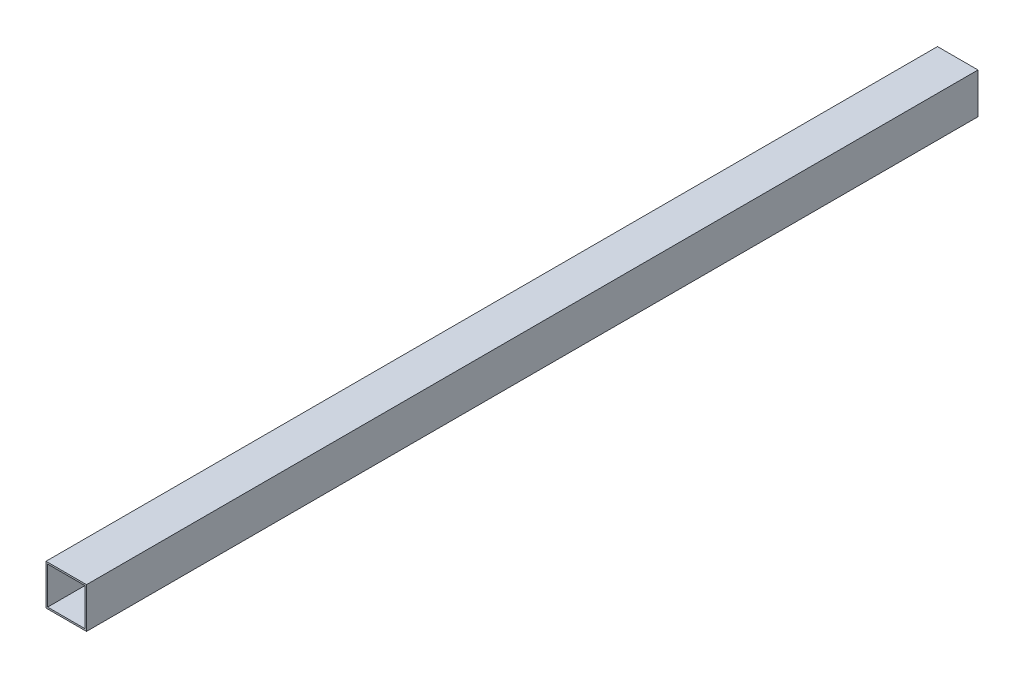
from build123d import *

# Parameters (mm, degrees)
SCHIZZO1_W                = 50
SCHIZZO1_H                = 50
SCHIZZO1_W_2              = 46
SCHIZZO1_H_2              = 46
ESTRUSIONE_SOTTILE1_DEPTH = 1100


with BuildPart() as part:
    # Schizzo1 → Estrusione-Sottile1 (new body)
    with BuildSketch(Plane.XY):
        Rectangle(SCHIZZO1_W, SCHIZZO1_H)
        Rectangle(SCHIZZO1_W_2, SCHIZZO1_H_2, mode=Mode.SUBTRACT)
    extrude(amount=ESTRUSIONE_SOTTILE1_DEPTH)


solid = part.part
